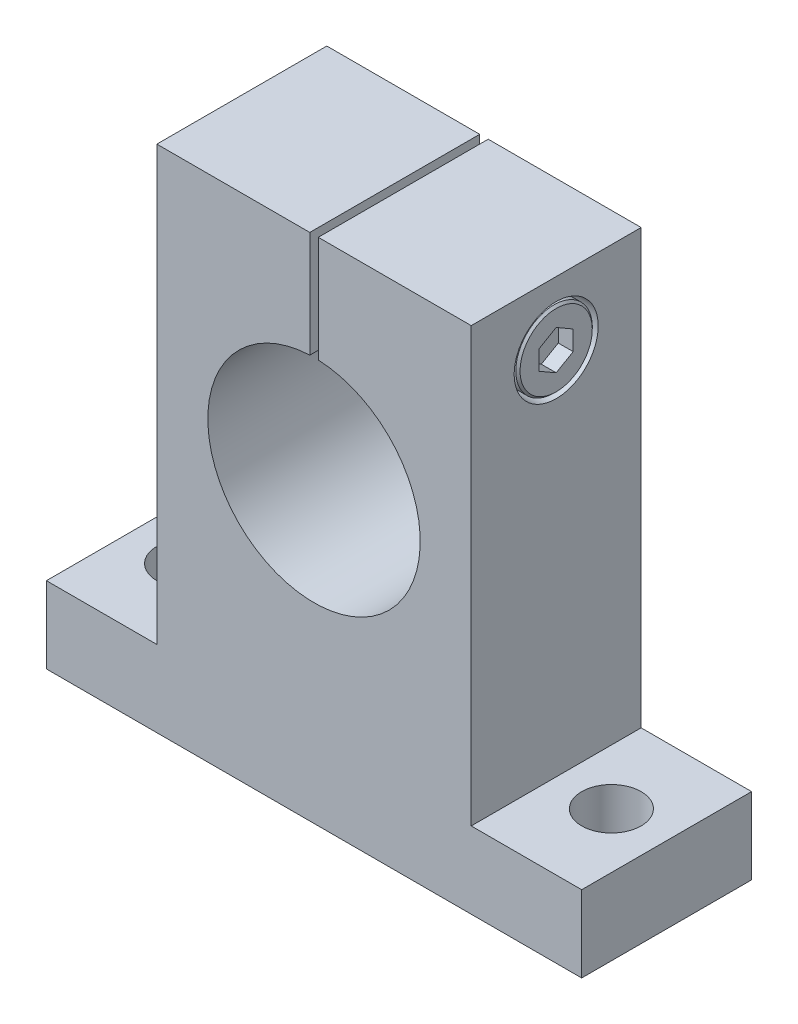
ISO-10303-21;
HEADER;
FILE_DESCRIPTION(('STEP AP214'),'2;1');
FILE_NAME('part.step','',(''),(''),'','','');
FILE_SCHEMA(('AUTOMOTIVE_DESIGN { 1 0 10303 214 1 1 1 1 }'));
ENDSEC;
DATA;
#1=APPLICATION_CONTEXT('core data for automotive mechanical design processes');
#2=APPLICATION_PROTOCOL_DEFINITION('international standard','automotive_design',2000,#1);
#3=PRODUCT_CONTEXT('',#1,'mechanical');
#4=PRODUCT('Part','Part','',(#3));
#5=PRODUCT_RELATED_PRODUCT_CATEGORY('part','',(#4));
#6=PRODUCT_DEFINITION_FORMATION('','',#4);
#7=PRODUCT_DEFINITION_CONTEXT('part definition',#1,'design');
#8=PRODUCT_DEFINITION('design','',#6,#7);
#9=PRODUCT_DEFINITION_SHAPE('','',#8);
#10=(LENGTH_UNIT() NAMED_UNIT(*) SI_UNIT(.MILLI.,.METRE.));
#11=(NAMED_UNIT(*) PLANE_ANGLE_UNIT() SI_UNIT($,.RADIAN.));
#12=(NAMED_UNIT(*) SI_UNIT($,.STERADIAN.) SOLID_ANGLE_UNIT());
#13=UNCERTAINTY_MEASURE_WITH_UNIT(LENGTH_MEASURE(1.E-05),#10,'distance_accuracy_value','');
#14=(GEOMETRIC_REPRESENTATION_CONTEXT(3) GLOBAL_UNCERTAINTY_ASSIGNED_CONTEXT((#13)) GLOBAL_UNIT_ASSIGNED_CONTEXT((#10,
#11,#12)) REPRESENTATION_CONTEXT('',''));
#15=CARTESIAN_POINT('',(0.,0.,0.));
#16=DIRECTION('',(0.,0.,1.));
#17=DIRECTION('',(1.,0.,0.));
#18=AXIS2_PLACEMENT_3D('',#15,#16,#17);
#19=CARTESIAN_POINT('',(0.,0.,-40.));
#20=DIRECTION('',(0.,0.,1.));
#21=DIRECTION('',(1.,0.,0.));
#22=AXIS2_PLACEMENT_3D('',#19,#20,#21);
#23=PLANE('',#22);
#24=DIRECTION('',(0.,1.,0.));
#25=VECTOR('',#24,1.);
#26=CARTESIAN_POINT('',(1.,0.,-40.));
#27=LINE('',#26,#25);
#28=CARTESIAN_POINT('',(1.,24.9799919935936,-40.));
#29=VERTEX_POINT('',#28);
#30=CARTESIAN_POINT('',(1.,50.,-40.));
#31=VERTEX_POINT('',#30);
#32=EDGE_CURVE('E323',#29,#31,#27,.T.);
#33=ORIENTED_EDGE('',*,*,#32,.T.);
#34=DIRECTION('',(-1.,0.,0.));
#35=VECTOR('',#34,1.);
#36=CARTESIAN_POINT('',(37.,50.,-40.));
#37=LINE('',#36,#35);
#38=CARTESIAN_POINT('',(37.,50.,-40.));
#39=VERTEX_POINT('',#38);
#40=EDGE_CURVE('E281',#39,#31,#37,.T.);
#41=ORIENTED_EDGE('',*,*,#40,.F.);
#42=DIRECTION('',(0.,1.,0.));
#43=VECTOR('',#42,1.);
#44=CARTESIAN_POINT('',(37.,-52.,-40.));
#45=LINE('',#44,#43);
#46=CARTESIAN_POINT('',(37.,-52.,-40.));
#47=VERTEX_POINT('',#46);
#48=EDGE_CURVE('E143',#47,#39,#45,.T.);
#49=ORIENTED_EDGE('',*,*,#48,.F.);
#50=DIRECTION('',(-1.,0.,0.));
#51=VECTOR('',#50,1.);
#52=CARTESIAN_POINT('',(63.,-52.,-40.));
#53=LINE('',#52,#51);
#54=CARTESIAN_POINT('',(63.,-52.,-40.));
#55=VERTEX_POINT('',#54);
#56=EDGE_CURVE('E133',#55,#47,#53,.T.);
#57=ORIENTED_EDGE('',*,*,#56,.F.);
#58=DIRECTION('',(0.,1.,0.));
#59=VECTOR('',#58,1.);
#60=CARTESIAN_POINT('',(63.,-70.,-40.));
#61=LINE('',#60,#59);
#62=CARTESIAN_POINT('',(63.,-70.,-40.));
#63=VERTEX_POINT('',#62);
#64=EDGE_CURVE('E373',#63,#55,#61,.T.);
#65=ORIENTED_EDGE('',*,*,#64,.F.);
#66=DIRECTION('',(1.,0.,0.));
#67=VECTOR('',#66,1.);
#68=CARTESIAN_POINT('',(-63.,-70.,-40.));
#69=LINE('',#68,#67);
#70=CARTESIAN_POINT('',(-63.,-70.,-40.));
#71=VERTEX_POINT('',#70);
#72=EDGE_CURVE('E10',#71,#63,#69,.T.);
#73=ORIENTED_EDGE('',*,*,#72,.F.);
#74=DIRECTION('',(0.,-1.,0.));
#75=VECTOR('',#74,1.);
#76=CARTESIAN_POINT('',(-63.,-52.,-40.));
#77=LINE('',#76,#75);
#78=CARTESIAN_POINT('',(-63.,-52.,-40.));
#79=VERTEX_POINT('',#78);
#80=EDGE_CURVE('E345',#79,#71,#77,.T.);
#81=ORIENTED_EDGE('',*,*,#80,.F.);
#82=DIRECTION('',(-1.,0.,0.));
#83=VECTOR('',#82,1.);
#84=CARTESIAN_POINT('',(-37.,-52.,-40.));
#85=LINE('',#84,#83);
#86=CARTESIAN_POINT('',(-37.,-52.,-40.));
#87=VERTEX_POINT('',#86);
#88=EDGE_CURVE('E306',#87,#79,#85,.T.);
#89=ORIENTED_EDGE('',*,*,#88,.F.);
#90=DIRECTION('',(0.,-1.,0.));
#91=VECTOR('',#90,1.);
#92=CARTESIAN_POINT('',(-37.,50.,-40.));
#93=LINE('',#92,#91);
#94=CARTESIAN_POINT('',(-37.,50.,-40.));
#95=VERTEX_POINT('',#94);
#96=EDGE_CURVE('E284',#95,#87,#93,.T.);
#97=ORIENTED_EDGE('',*,*,#96,.F.);
#98=DIRECTION('',(-1.,0.,0.));
#99=VECTOR('',#98,1.);
#100=CARTESIAN_POINT('',(37.,50.,-40.));
#101=LINE('',#100,#99);
#102=CARTESIAN_POINT('',(-1.,50.,-40.));
#103=VERTEX_POINT('',#102);
#104=EDGE_CURVE('E296',#103,#95,#101,.T.);
#105=ORIENTED_EDGE('',*,*,#104,.F.);
#106=DIRECTION('',(0.,-1.,0.));
#107=VECTOR('',#106,1.);
#108=CARTESIAN_POINT('',(-1.,25.,-40.));
#109=LINE('',#108,#107);
#110=CARTESIAN_POINT('',(-1.,24.9799919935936,-40.));
#111=VERTEX_POINT('',#110);
#112=EDGE_CURVE('E327',#103,#111,#109,.T.);
#113=ORIENTED_EDGE('',*,*,#112,.T.);
#114=CARTESIAN_POINT('',(0.,0.,-40.));
#115=DIRECTION('',(0.,0.,1.));
#116=DIRECTION('',(1.,0.,0.));
#117=AXIS2_PLACEMENT_3D('',#114,#115,#116);
#118=CIRCLE('',#117,25.);
#119=EDGE_CURVE('E470',#111,#29,#118,.T.);
#120=ORIENTED_EDGE('',*,*,#119,.T.);
#121=EDGE_LOOP('',(#33,#41,#49,#57,#65,#73,#81,#89,#97,#105,#113,#120));
#122=FACE_BOUND('',#121,.T.);
#123=ADVANCED_FACE('F16',(#122),#23,.F.);
#124=CARTESIAN_POINT('',(-63.,-70.,0.));
#125=DIRECTION('',(0.,-1.,0.));
#126=DIRECTION('',(0.,0.,-1.));
#127=AXIS2_PLACEMENT_3D('',#124,#125,#126);
#128=PLANE('',#127);
#129=CARTESIAN_POINT('',(50.,-70.,-20.));
#130=DIRECTION('',(0.,1.,0.));
#131=DIRECTION('',(0.,0.,-1.));
#132=AXIS2_PLACEMENT_3D('',#129,#130,#131);
#133=CIRCLE('',#132,7.);
#134=CARTESIAN_POINT('',(50.,-70.,-13.));
#135=VERTEX_POINT('',#134);
#136=EDGE_CURVE('E666',#135,#135,#133,.T.);
#137=ORIENTED_EDGE('',*,*,#136,.T.);
#138=EDGE_LOOP('',(#137));
#139=FACE_BOUND('',#138,.T.);
#140=CARTESIAN_POINT('',(-50.,-70.,-20.));
#141=DIRECTION('',(0.,1.,0.));
#142=DIRECTION('',(0.,0.,-1.));
#143=AXIS2_PLACEMENT_3D('',#140,#141,#142);
#144=CIRCLE('',#143,7.);
#145=CARTESIAN_POINT('',(-50.,-70.,-13.));
#146=VERTEX_POINT('',#145);
#147=EDGE_CURVE('E706',#146,#146,#144,.T.);
#148=ORIENTED_EDGE('',*,*,#147,.T.);
#149=EDGE_LOOP('',(#148));
#150=FACE_BOUND('',#149,.T.);
#151=ORIENTED_EDGE('',*,*,#72,.T.);
#152=DIRECTION('',(0.,0.,-1.));
#153=VECTOR('',#152,1.);
#154=CARTESIAN_POINT('',(63.,-70.,0.));
#155=LINE('',#154,#153);
#156=CARTESIAN_POINT('',(63.,-70.,0.));
#157=VERTEX_POINT('',#156);
#158=EDGE_CURVE('E377',#157,#63,#155,.T.);
#159=ORIENTED_EDGE('',*,*,#158,.F.);
#160=DIRECTION('',(1.,0.,0.));
#161=VECTOR('',#160,1.);
#162=CARTESIAN_POINT('',(-63.,-70.,0.));
#163=LINE('',#162,#161);
#164=CARTESIAN_POINT('',(-63.,-70.,0.));
#165=VERTEX_POINT('',#164);
#166=EDGE_CURVE('E319',#165,#157,#163,.T.);
#167=ORIENTED_EDGE('',*,*,#166,.F.);
#168=DIRECTION('',(0.,0.,-1.));
#169=VECTOR('',#168,1.);
#170=CARTESIAN_POINT('',(-63.,-70.,0.));
#171=LINE('',#170,#169);
#172=EDGE_CURVE('E19',#165,#71,#171,.T.);
#173=ORIENTED_EDGE('',*,*,#172,.T.);
#174=EDGE_LOOP('',(#151,#159,#167,#173));
#175=FACE_BOUND('',#174,.T.);
#176=ADVANCED_FACE('F532',(#139,#150,#175),#128,.T.);
#177=CARTESIAN_POINT('',(-63.,-52.,0.));
#178=DIRECTION('',(-1.,0.,0.));
#179=DIRECTION('',(0.,0.,1.));
#180=AXIS2_PLACEMENT_3D('',#177,#178,#179);
#181=PLANE('',#180);
#182=ORIENTED_EDGE('',*,*,#80,.T.);
#183=ORIENTED_EDGE('',*,*,#172,.F.);
#184=DIRECTION('',(0.,-1.,0.));
#185=VECTOR('',#184,1.);
#186=CARTESIAN_POINT('',(-63.,-52.,0.));
#187=LINE('',#186,#185);
#188=CARTESIAN_POINT('',(-63.,-52.,0.));
#189=VERTEX_POINT('',#188);
#190=EDGE_CURVE('E335',#189,#165,#187,.T.);
#191=ORIENTED_EDGE('',*,*,#190,.F.);
#192=DIRECTION('',(0.,0.,-1.));
#193=VECTOR('',#192,1.);
#194=CARTESIAN_POINT('',(-63.,-52.,0.));
#195=LINE('',#194,#193);
#196=EDGE_CURVE('E349',#189,#79,#195,.T.);
#197=ORIENTED_EDGE('',*,*,#196,.T.);
#198=EDGE_LOOP('',(#182,#183,#191,#197));
#199=FACE_BOUND('',#198,.T.);
#200=ADVANCED_FACE('F400',(#199),#181,.T.);
#201=CARTESIAN_POINT('',(-37.,-52.,0.));
#202=DIRECTION('',(0.,1.,0.));
#203=DIRECTION('',(1.,0.,0.));
#204=AXIS2_PLACEMENT_3D('',#201,#202,#203);
#205=PLANE('',#204);
#206=CARTESIAN_POINT('',(-50.,-52.,-20.));
#207=DIRECTION('',(0.,-1.,0.));
#208=DIRECTION('',(0.,0.,-1.));
#209=AXIS2_PLACEMENT_3D('',#206,#207,#208);
#210=CIRCLE('',#209,7.);
#211=CARTESIAN_POINT('',(-50.,-52.,-13.));
#212=VERTEX_POINT('',#211);
#213=EDGE_CURVE('E660',#212,#212,#210,.T.);
#214=ORIENTED_EDGE('',*,*,#213,.T.);
#215=EDGE_LOOP('',(#214));
#216=FACE_BOUND('',#215,.T.);
#217=ORIENTED_EDGE('',*,*,#88,.T.);
#218=ORIENTED_EDGE('',*,*,#196,.F.);
#219=DIRECTION('',(-1.,0.,0.));
#220=VECTOR('',#219,1.);
#221=CARTESIAN_POINT('',(-37.,-52.,0.));
#222=LINE('',#221,#220);
#223=CARTESIAN_POINT('',(-37.,-52.,0.));
#224=VERTEX_POINT('',#223);
#225=EDGE_CURVE('E353',#224,#189,#222,.T.);
#226=ORIENTED_EDGE('',*,*,#225,.F.);
#227=DIRECTION('',(0.,0.,-1.));
#228=VECTOR('',#227,1.);
#229=CARTESIAN_POINT('',(-37.,-52.,0.));
#230=LINE('',#229,#228);
#231=EDGE_CURVE('E302',#224,#87,#230,.T.);
#232=ORIENTED_EDGE('',*,*,#231,.T.);
#233=EDGE_LOOP('',(#217,#218,#226,#232));
#234=FACE_BOUND('',#233,.T.);
#235=ADVANCED_FACE('F404',(#216,#234),#205,.T.);
#236=CARTESIAN_POINT('',(-37.,50.,0.));
#237=DIRECTION('',(-1.,0.,0.));
#238=DIRECTION('',(0.,0.,1.));
#239=AXIS2_PLACEMENT_3D('',#236,#237,#238);
#240=PLANE('',#239);
#241=ORIENTED_EDGE('',*,*,#96,.T.);
#242=ORIENTED_EDGE('',*,*,#231,.F.);
#243=DIRECTION('',(0.,-1.,0.));
#244=VECTOR('',#243,1.);
#245=CARTESIAN_POINT('',(-37.,50.,0.));
#246=LINE('',#245,#244);
#247=CARTESIAN_POINT('',(-37.,50.,0.));
#248=VERTEX_POINT('',#247);
#249=EDGE_CURVE('E344',#248,#224,#246,.T.);
#250=ORIENTED_EDGE('',*,*,#249,.F.);
#251=DIRECTION('',(0.,0.,-1.));
#252=VECTOR('',#251,1.);
#253=CARTESIAN_POINT('',(-37.,50.,0.));
#254=LINE('',#253,#252);
#255=EDGE_CURVE('E369',#248,#95,#254,.T.);
#256=ORIENTED_EDGE('',*,*,#255,.T.);
#257=EDGE_LOOP('',(#241,#242,#250,#256));
#258=FACE_BOUND('',#257,.T.);
#259=ADVANCED_FACE('F456',(#258),#240,.T.);
#260=CARTESIAN_POINT('',(37.,50.,0.));
#261=DIRECTION('',(0.,1.,0.));
#262=DIRECTION('',(1.,0.,0.));
#263=AXIS2_PLACEMENT_3D('',#260,#261,#262);
#264=PLANE('',#263);
#265=DIRECTION('',(0.,0.,1.));
#266=VECTOR('',#265,1.);
#267=CARTESIAN_POINT('',(1.,50.,0.));
#268=LINE('',#267,#266);
#269=CARTESIAN_POINT('',(1.,50.,0.));
#270=VERTEX_POINT('',#269);
#271=EDGE_CURVE('E313',#31,#270,#268,.T.);
#272=ORIENTED_EDGE('',*,*,#271,.T.);
#273=DIRECTION('',(-1.,0.,0.));
#274=VECTOR('',#273,1.);
#275=CARTESIAN_POINT('',(37.,50.,0.));
#276=LINE('',#275,#274);
#277=CARTESIAN_POINT('',(37.,50.,0.));
#278=VERTEX_POINT('',#277);
#279=EDGE_CURVE('E293',#278,#270,#276,.T.);
#280=ORIENTED_EDGE('',*,*,#279,.F.);
#281=DIRECTION('',(0.,0.,-1.));
#282=VECTOR('',#281,1.);
#283=CARTESIAN_POINT('',(37.,50.,0.));
#284=LINE('',#283,#282);
#285=EDGE_CURVE('E285',#278,#39,#284,.T.);
#286=ORIENTED_EDGE('',*,*,#285,.T.);
#287=ORIENTED_EDGE('',*,*,#40,.T.);
#288=EDGE_LOOP('',(#272,#280,#286,#287));
#289=FACE_BOUND('',#288,.T.);
#290=ADVANCED_FACE('F812',(#289),#264,.T.);
#291=CARTESIAN_POINT('',(37.,-52.,0.));
#292=DIRECTION('',(1.,0.,0.));
#293=DIRECTION('',(0.,1.,0.));
#294=AXIS2_PLACEMENT_3D('',#291,#292,#293);
#295=PLANE('',#294);
#296=CARTESIAN_POINT('',(37.,35.,-20.));
#297=DIRECTION('',(-1.,0.,0.));
#298=DIRECTION('',(0.,0.,-1.));
#299=AXIS2_PLACEMENT_3D('',#296,#297,#298);
#300=CIRCLE('',#299,9.9);
#301=CARTESIAN_POINT('',(37.,35.,-10.1));
#302=VERTEX_POINT('',#301);
#303=EDGE_CURVE('E483',#302,#302,#300,.T.);
#304=ORIENTED_EDGE('',*,*,#303,.T.);
#305=EDGE_LOOP('',(#304));
#306=FACE_BOUND('',#305,.T.);
#307=ORIENTED_EDGE('',*,*,#48,.T.);
#308=ORIENTED_EDGE('',*,*,#285,.F.);
#309=DIRECTION('',(0.,1.,0.));
#310=VECTOR('',#309,1.);
#311=CARTESIAN_POINT('',(37.,-52.,0.));
#312=LINE('',#311,#310);
#313=CARTESIAN_POINT('',(37.,-52.,0.));
#314=VERTEX_POINT('',#313);
#315=EDGE_CURVE('E297',#314,#278,#312,.T.);
#316=ORIENTED_EDGE('',*,*,#315,.F.);
#317=DIRECTION('',(0.,0.,-1.));
#318=VECTOR('',#317,1.);
#319=CARTESIAN_POINT('',(37.,-52.,0.));
#320=LINE('',#319,#318);
#321=EDGE_CURVE('E381',#314,#47,#320,.T.);
#322=ORIENTED_EDGE('',*,*,#321,.T.);
#323=EDGE_LOOP('',(#307,#308,#316,#322));
#324=FACE_BOUND('',#323,.T.);
#325=ADVANCED_FACE('F484',(#306,#324),#295,.T.);
#326=CARTESIAN_POINT('',(63.,-52.,0.));
#327=DIRECTION('',(0.,1.,0.));
#328=DIRECTION('',(1.,0.,0.));
#329=AXIS2_PLACEMENT_3D('',#326,#327,#328);
#330=PLANE('',#329);
#331=CARTESIAN_POINT('',(50.,-52.,-20.));
#332=DIRECTION('',(0.,-1.,0.));
#333=DIRECTION('',(0.,0.,-1.));
#334=AXIS2_PLACEMENT_3D('',#331,#332,#333);
#335=CIRCLE('',#334,7.);
#336=CARTESIAN_POINT('',(50.,-52.,-13.));
#337=VERTEX_POINT('',#336);
#338=EDGE_CURVE('E674',#337,#337,#335,.T.);
#339=ORIENTED_EDGE('',*,*,#338,.T.);
#340=EDGE_LOOP('',(#339));
#341=FACE_BOUND('',#340,.T.);
#342=ORIENTED_EDGE('',*,*,#56,.T.);
#343=ORIENTED_EDGE('',*,*,#321,.F.);
#344=DIRECTION('',(-1.,0.,0.));
#345=VECTOR('',#344,1.);
#346=CARTESIAN_POINT('',(63.,-52.,0.));
#347=LINE('',#346,#345);
#348=CARTESIAN_POINT('',(63.,-52.,0.));
#349=VERTEX_POINT('',#348);
#350=EDGE_CURVE('E318',#349,#314,#347,.T.);
#351=ORIENTED_EDGE('',*,*,#350,.F.);
#352=DIRECTION('',(0.,0.,-1.));
#353=VECTOR('',#352,1.);
#354=CARTESIAN_POINT('',(63.,-52.,0.));
#355=LINE('',#354,#353);
#356=EDGE_CURVE('E374',#349,#55,#355,.T.);
#357=ORIENTED_EDGE('',*,*,#356,.T.);
#358=EDGE_LOOP('',(#342,#343,#351,#357));
#359=FACE_BOUND('',#358,.T.);
#360=ADVANCED_FACE('F814',(#341,#359),#330,.T.);
#361=CARTESIAN_POINT('',(63.,-70.,0.));
#362=DIRECTION('',(1.,0.,0.));
#363=DIRECTION('',(0.,1.,0.));
#364=AXIS2_PLACEMENT_3D('',#361,#362,#363);
#365=PLANE('',#364);
#366=ORIENTED_EDGE('',*,*,#64,.T.);
#367=ORIENTED_EDGE('',*,*,#356,.F.);
#368=DIRECTION('',(0.,1.,0.));
#369=VECTOR('',#368,1.);
#370=CARTESIAN_POINT('',(63.,-70.,0.));
#371=LINE('',#370,#369);
#372=EDGE_CURVE('E314',#157,#349,#371,.T.);
#373=ORIENTED_EDGE('',*,*,#372,.F.);
#374=ORIENTED_EDGE('',*,*,#158,.T.);
#375=EDGE_LOOP('',(#366,#367,#373,#374));
#376=FACE_BOUND('',#375,.T.);
#377=ADVANCED_FACE('F527',(#376),#365,.T.);
#378=CARTESIAN_POINT('',(37.,50.,0.));
#379=DIRECTION('',(0.,1.,0.));
#380=DIRECTION('',(1.,0.,0.));
#381=AXIS2_PLACEMENT_3D('',#378,#379,#380);
#382=PLANE('',#381);
#383=DIRECTION('',(0.,0.,-1.));
#384=VECTOR('',#383,1.);
#385=CARTESIAN_POINT('',(-1.,50.,0.));
#386=LINE('',#385,#384);
#387=CARTESIAN_POINT('',(-1.,50.,0.));
#388=VERTEX_POINT('',#387);
#389=EDGE_CURVE('E331',#388,#103,#386,.T.);
#390=ORIENTED_EDGE('',*,*,#389,.T.);
#391=ORIENTED_EDGE('',*,*,#104,.T.);
#392=ORIENTED_EDGE('',*,*,#255,.F.);
#393=DIRECTION('',(-1.,0.,0.));
#394=VECTOR('',#393,1.);
#395=CARTESIAN_POINT('',(37.,50.,0.));
#396=LINE('',#395,#394);
#397=EDGE_CURVE('E340',#388,#248,#396,.T.);
#398=ORIENTED_EDGE('',*,*,#397,.F.);
#399=EDGE_LOOP('',(#390,#391,#392,#398));
#400=FACE_BOUND('',#399,.T.);
#401=ADVANCED_FACE('F458',(#400),#382,.T.);
#402=CARTESIAN_POINT('',(0.,0.,0.));
#403=DIRECTION('',(0.,0.,1.));
#404=DIRECTION('',(1.,0.,0.));
#405=AXIS2_PLACEMENT_3D('',#402,#403,#404);
#406=PLANE('',#405);
#407=DIRECTION('',(0.,-1.,0.));
#408=VECTOR('',#407,1.);
#409=CARTESIAN_POINT('',(1.,0.,0.));
#410=LINE('',#409,#408);
#411=CARTESIAN_POINT('',(1.,24.9799919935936,0.));
#412=VERTEX_POINT('',#411);
#413=EDGE_CURVE('E234',#270,#412,#410,.T.);
#414=ORIENTED_EDGE('',*,*,#413,.T.);
#415=CARTESIAN_POINT('',(0.,0.,0.));
#416=DIRECTION('',(0.,0.,-1.));
#417=DIRECTION('',(1.,0.,0.));
#418=AXIS2_PLACEMENT_3D('',#415,#416,#417);
#419=CIRCLE('',#418,25.);
#420=CARTESIAN_POINT('',(-1.,24.9799919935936,0.));
#421=VERTEX_POINT('',#420);
#422=EDGE_CURVE('E646',#412,#421,#419,.T.);
#423=ORIENTED_EDGE('',*,*,#422,.T.);
#424=DIRECTION('',(0.,1.,0.));
#425=VECTOR('',#424,1.);
#426=CARTESIAN_POINT('',(-1.,25.,0.));
#427=LINE('',#426,#425);
#428=EDGE_CURVE('E339',#421,#388,#427,.T.);
#429=ORIENTED_EDGE('',*,*,#428,.T.);
#430=ORIENTED_EDGE('',*,*,#397,.T.);
#431=ORIENTED_EDGE('',*,*,#249,.T.);
#432=ORIENTED_EDGE('',*,*,#225,.T.);
#433=ORIENTED_EDGE('',*,*,#190,.T.);
#434=ORIENTED_EDGE('',*,*,#166,.T.);
#435=ORIENTED_EDGE('',*,*,#372,.T.);
#436=ORIENTED_EDGE('',*,*,#350,.T.);
#437=ORIENTED_EDGE('',*,*,#315,.T.);
#438=ORIENTED_EDGE('',*,*,#279,.T.);
#439=EDGE_LOOP('',(#414,#423,#429,#430,#431,#432,#433,#434,#435,#436,#437,#438));
#440=FACE_BOUND('',#439,.T.);
#441=ADVANCED_FACE('F808',(#440),#406,.T.);
#442=CARTESIAN_POINT('',(-1.,50.,0.));
#443=DIRECTION('',(-1.,0.,0.));
#444=DIRECTION('',(0.,0.,1.));
#445=AXIS2_PLACEMENT_3D('',#442,#443,#444);
#446=PLANE('',#445);
#447=CARTESIAN_POINT('',(-1.,35.,-20.));
#448=DIRECTION('',(-1.,0.,0.));
#449=DIRECTION('',(0.,1.,0.));
#450=AXIS2_PLACEMENT_3D('',#447,#448,#449);
#451=CIRCLE('',#450,6.);
#452=CARTESIAN_POINT('',(-1.,29.,-20.));
#453=VERTEX_POINT('',#452);
#454=EDGE_CURVE('E502',#453,#453,#451,.T.);
#455=ORIENTED_EDGE('',*,*,#454,.T.);
#456=EDGE_LOOP('',(#455));
#457=FACE_BOUND('',#456,.T.);
#458=DIRECTION('',(0.,0.,1.));
#459=VECTOR('',#458,1.);
#460=CARTESIAN_POINT('',(-1.,24.9799919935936,-20.));
#461=LINE('',#460,#459);
#462=EDGE_CURVE('E467',#111,#421,#461,.T.);
#463=ORIENTED_EDGE('',*,*,#462,.F.);
#464=ORIENTED_EDGE('',*,*,#112,.F.);
#465=ORIENTED_EDGE('',*,*,#389,.F.);
#466=ORIENTED_EDGE('',*,*,#428,.F.);
#467=EDGE_LOOP('',(#463,#464,#465,#466));
#468=FACE_BOUND('',#467,.T.);
#469=ADVANCED_FACE('F464',(#457,#468),#446,.F.);
#470=CARTESIAN_POINT('',(1.,0.,0.));
#471=DIRECTION('',(1.,0.,0.));
#472=DIRECTION('',(0.,1.,0.));
#473=AXIS2_PLACEMENT_3D('',#470,#471,#472);
#474=PLANE('',#473);
#475=CARTESIAN_POINT('',(1.,35.,-20.));
#476=DIRECTION('',(1.,0.,0.));
#477=DIRECTION('',(0.,1.,0.));
#478=AXIS2_PLACEMENT_3D('',#475,#476,#477);
#479=CIRCLE('',#478,6.);
#480=CARTESIAN_POINT('',(1.,29.,-20.));
#481=VERTEX_POINT('',#480);
#482=EDGE_CURVE('E699',#481,#481,#479,.T.);
#483=ORIENTED_EDGE('',*,*,#482,.T.);
#484=EDGE_LOOP('',(#483));
#485=FACE_BOUND('',#484,.T.);
#486=DIRECTION('',(0.,0.,-1.));
#487=VECTOR('',#486,1.);
#488=CARTESIAN_POINT('',(1.,24.9799919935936,-20.));
#489=LINE('',#488,#487);
#490=EDGE_CURVE('E656',#412,#29,#489,.T.);
#491=ORIENTED_EDGE('',*,*,#490,.F.);
#492=ORIENTED_EDGE('',*,*,#413,.F.);
#493=ORIENTED_EDGE('',*,*,#271,.F.);
#494=ORIENTED_EDGE('',*,*,#32,.F.);
#495=EDGE_LOOP('',(#491,#492,#493,#494));
#496=FACE_BOUND('',#495,.T.);
#497=ADVANCED_FACE('F796',(#485,#496),#474,.F.);
#498=CARTESIAN_POINT('',(30.,0.,0.));
#499=DIRECTION('',(1.,0.,0.));
#500=DIRECTION('',(0.,1.,0.));
#501=AXIS2_PLACEMENT_3D('',#498,#499,#500);
#502=PLANE('',#501);
#503=CARTESIAN_POINT('',(30.,35.,-20.));
#504=DIRECTION('',(-1.,0.,0.));
#505=DIRECTION('',(0.,1.,0.));
#506=AXIS2_PLACEMENT_3D('',#503,#504,#505);
#507=CIRCLE('',#506,9.);
#508=CARTESIAN_POINT('',(30.,26.,-20.));
#509=VERTEX_POINT('',#508);
#510=EDGE_CURVE('E508',#509,#509,#507,.T.);
#511=ORIENTED_EDGE('',*,*,#510,.T.);
#512=EDGE_LOOP('',(#511));
#513=FACE_BOUND('',#512,.T.);
#514=CARTESIAN_POINT('',(30.,35.,-20.));
#515=DIRECTION('',(1.,0.,0.));
#516=DIRECTION('',(0.,0.,-1.));
#517=AXIS2_PLACEMENT_3D('',#514,#515,#516);
#518=CIRCLE('',#517,9.9);
#519=CARTESIAN_POINT('',(30.,35.,-10.1));
#520=VERTEX_POINT('',#519);
#521=EDGE_CURVE('E499',#520,#520,#518,.T.);
#522=ORIENTED_EDGE('',*,*,#521,.T.);
#523=EDGE_LOOP('',(#522));
#524=FACE_BOUND('',#523,.T.);
#525=ADVANCED_FACE('F799',(#513,#524),#502,.T.);
#526=CARTESIAN_POINT('',(37.,39.25,-20.));
#527=DIRECTION('',(1.,0.,0.));
#528=DIRECTION('',(0.,1.,0.));
#529=AXIS2_PLACEMENT_3D('',#526,#527,#528);
#530=PLANE('',#529);
#531=DIRECTION('',(0.,0.5,0.866025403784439));
#532=VECTOR('',#531,1.);
#533=CARTESIAN_POINT('',(37.,32.6444986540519,-16.079848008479));
#534=LINE('',#533,#532);
#535=CARTESIAN_POINT('',(37.,30.381197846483,-20.));
#536=VERTEX_POINT('',#535);
#537=CARTESIAN_POINT('',(37.,32.6905989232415,-16.));
#538=VERTEX_POINT('',#537);
#539=EDGE_CURVE('E238',#536,#538,#534,.T.);
#540=ORIENTED_EDGE('',*,*,#539,.T.);
#541=DIRECTION('',(0.,1.,0.));
#542=VECTOR('',#541,1.);
#543=CARTESIAN_POINT('',(37.,38.2797005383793,-16.));
#544=LINE('',#543,#542);
#545=CARTESIAN_POINT('',(37.,37.3094010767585,-16.));
#546=VERTEX_POINT('',#545);
#547=EDGE_CURVE('E223',#538,#546,#544,.T.);
#548=ORIENTED_EDGE('',*,*,#547,.T.);
#549=DIRECTION('',(0.,0.5,-0.866025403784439));
#550=VECTOR('',#549,1.);
#551=CARTESIAN_POINT('',(37.,39.5727018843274,-19.920151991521));
#552=LINE('',#551,#550);
#553=CARTESIAN_POINT('',(37.,39.618802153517,-20.));
#554=VERTEX_POINT('',#553);
#555=EDGE_CURVE('E269',#546,#554,#552,.T.);
#556=ORIENTED_EDGE('',*,*,#555,.T.);
#557=DIRECTION('',(0.,-0.5,-0.866025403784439));
#558=VECTOR('',#557,1.);
#559=CARTESIAN_POINT('',(37.,38.4180013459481,-22.079848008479));
#560=LINE('',#559,#558);
#561=CARTESIAN_POINT('',(37.,37.3094010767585,-24.));
#562=VERTEX_POINT('',#561);
#563=EDGE_CURVE('E289',#554,#562,#560,.T.);
#564=ORIENTED_EDGE('',*,*,#563,.T.);
#565=DIRECTION('',(0.,-1.,0.));
#566=VECTOR('',#565,1.);
#567=CARTESIAN_POINT('',(37.,35.9702994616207,-24.));
#568=LINE('',#567,#566);
#569=CARTESIAN_POINT('',(37.,32.6905989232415,-24.));
#570=VERTEX_POINT('',#569);
#571=EDGE_CURVE('E273',#562,#570,#568,.T.);
#572=ORIENTED_EDGE('',*,*,#571,.T.);
#573=DIRECTION('',(0.,-0.5,0.866025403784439));
#574=VECTOR('',#573,1.);
#575=CARTESIAN_POINT('',(37.,31.4897981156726,-21.920151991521));
#576=LINE('',#575,#574);
#577=EDGE_CURVE('E242',#570,#536,#576,.T.);
#578=ORIENTED_EDGE('',*,*,#577,.T.);
#579=EDGE_LOOP('',(#540,#548,#556,#564,#572,#578));
#580=FACE_BOUND('',#579,.T.);
#581=CARTESIAN_POINT('',(37.,35.,-20.));
#582=DIRECTION('',(-1.,0.,0.));
#583=DIRECTION('',(0.,1.,0.));
#584=AXIS2_PLACEMENT_3D('',#581,#582,#583);
#585=CIRCLE('',#584,8.5);
#586=CARTESIAN_POINT('',(37.,26.5,-20.));
#587=VERTEX_POINT('',#586);
#588=EDGE_CURVE('E256',#587,#587,#585,.T.);
#589=ORIENTED_EDGE('',*,*,#588,.F.);
#590=EDGE_LOOP('',(#589));
#591=FACE_BOUND('',#590,.T.);
#592=ADVANCED_FACE('F239',(#580,#591),#530,.T.);
#593=CARTESIAN_POINT('',(33.5,0.,0.));
#594=DIRECTION('',(1.,0.,0.));
#595=DIRECTION('',(0.,1.,0.));
#596=AXIS2_PLACEMENT_3D('',#593,#594,#595);
#597=PLANE('',#596);
#598=DIRECTION('',(0.,-0.5,-0.866025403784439));
#599=VECTOR('',#598,1.);
#600=CARTESIAN_POINT('',(33.5,32.6905989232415,-16.));
#601=LINE('',#600,#599);
#602=CARTESIAN_POINT('',(33.5,32.6905989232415,-16.));
#603=VERTEX_POINT('',#602);
#604=CARTESIAN_POINT('',(33.5,30.381197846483,-20.));
#605=VERTEX_POINT('',#604);
#606=EDGE_CURVE('E249',#603,#605,#601,.T.);
#607=ORIENTED_EDGE('',*,*,#606,.T.);
#608=DIRECTION('',(0.,0.5,-0.866025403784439));
#609=VECTOR('',#608,1.);
#610=CARTESIAN_POINT('',(33.5,30.381197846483,-20.));
#611=LINE('',#610,#609);
#612=CARTESIAN_POINT('',(33.5,32.6905989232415,-24.));
#613=VERTEX_POINT('',#612);
#614=EDGE_CURVE('E216',#605,#613,#611,.T.);
#615=ORIENTED_EDGE('',*,*,#614,.T.);
#616=DIRECTION('',(0.,1.,0.));
#617=VECTOR('',#616,1.);
#618=CARTESIAN_POINT('',(33.5,32.6905989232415,-24.));
#619=LINE('',#618,#617);
#620=CARTESIAN_POINT('',(33.5,37.3094010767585,-24.));
#621=VERTEX_POINT('',#620);
#622=EDGE_CURVE('E272',#613,#621,#619,.T.);
#623=ORIENTED_EDGE('',*,*,#622,.T.);
#624=DIRECTION('',(0.,0.5,0.866025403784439));
#625=VECTOR('',#624,1.);
#626=CARTESIAN_POINT('',(33.5,37.3094010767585,-24.));
#627=LINE('',#626,#625);
#628=CARTESIAN_POINT('',(33.5,39.618802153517,-20.));
#629=VERTEX_POINT('',#628);
#630=EDGE_CURVE('E280',#621,#629,#627,.T.);
#631=ORIENTED_EDGE('',*,*,#630,.T.);
#632=DIRECTION('',(0.,-0.5,0.866025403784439));
#633=VECTOR('',#632,1.);
#634=CARTESIAN_POINT('',(33.5,39.618802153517,-20.));
#635=LINE('',#634,#633);
#636=CARTESIAN_POINT('',(33.5,37.3094010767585,-16.));
#637=VERTEX_POINT('',#636);
#638=EDGE_CURVE('E298',#629,#637,#635,.T.);
#639=ORIENTED_EDGE('',*,*,#638,.T.);
#640=DIRECTION('',(0.,-1.,0.));
#641=VECTOR('',#640,1.);
#642=CARTESIAN_POINT('',(33.5,37.3094010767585,-16.));
#643=LINE('',#642,#641);
#644=EDGE_CURVE('E235',#637,#603,#643,.T.);
#645=ORIENTED_EDGE('',*,*,#644,.T.);
#646=EDGE_LOOP('',(#607,#615,#623,#631,#639,#645));
#647=FACE_BOUND('',#646,.T.);
#648=ADVANCED_FACE('F882',(#647),#597,.T.);
#649=CARTESIAN_POINT('',(37.,37.3094010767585,-16.));
#650=DIRECTION('',(0.,0.,1.));
#651=DIRECTION('',(1.,0.,0.));
#652=AXIS2_PLACEMENT_3D('',#649,#650,#651);
#653=PLANE('',#652);
#654=ORIENTED_EDGE('',*,*,#644,.F.);
#655=DIRECTION('',(-1.,0.,0.));
#656=VECTOR('',#655,1.);
#657=CARTESIAN_POINT('',(37.,37.3094010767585,-16.));
#658=LINE('',#657,#656);
#659=EDGE_CURVE('E230',#546,#637,#658,.T.);
#660=ORIENTED_EDGE('',*,*,#659,.F.);
#661=ORIENTED_EDGE('',*,*,#547,.F.);
#662=DIRECTION('',(-1.,0.,0.));
#663=VECTOR('',#662,1.);
#664=CARTESIAN_POINT('',(37.,32.6905989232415,-16.));
#665=LINE('',#664,#663);
#666=EDGE_CURVE('E227',#538,#603,#665,.T.);
#667=ORIENTED_EDGE('',*,*,#666,.T.);
#668=EDGE_LOOP('',(#654,#660,#661,#667));
#669=FACE_BOUND('',#668,.T.);
#670=ADVANCED_FACE('F225',(#669),#653,.F.);
#671=CARTESIAN_POINT('',(37.,39.618802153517,-20.));
#672=DIRECTION('',(0.,0.866025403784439,0.5));
#673=DIRECTION('',(1.,0.,0.));
#674=AXIS2_PLACEMENT_3D('',#671,#672,#673);
#675=PLANE('',#674);
#676=ORIENTED_EDGE('',*,*,#638,.F.);
#677=DIRECTION('',(-1.,0.,0.));
#678=VECTOR('',#677,1.);
#679=CARTESIAN_POINT('',(37.,39.618802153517,-20.));
#680=LINE('',#679,#678);
#681=EDGE_CURVE('E292',#554,#629,#680,.T.);
#682=ORIENTED_EDGE('',*,*,#681,.F.);
#683=ORIENTED_EDGE('',*,*,#555,.F.);
#684=ORIENTED_EDGE('',*,*,#659,.T.);
#685=EDGE_LOOP('',(#676,#682,#683,#684));
#686=FACE_BOUND('',#685,.T.);
#687=ADVANCED_FACE('F875',(#686),#675,.F.);
#688=CARTESIAN_POINT('',(37.,37.3094010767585,-24.));
#689=DIRECTION('',(0.,0.866025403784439,-0.5));
#690=DIRECTION('',(-1.,0.,0.));
#691=AXIS2_PLACEMENT_3D('',#688,#689,#690);
#692=PLANE('',#691);
#693=ORIENTED_EDGE('',*,*,#630,.F.);
#694=DIRECTION('',(-1.,0.,0.));
#695=VECTOR('',#694,1.);
#696=CARTESIAN_POINT('',(37.,37.3094010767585,-24.));
#697=LINE('',#696,#695);
#698=EDGE_CURVE('E276',#562,#621,#697,.T.);
#699=ORIENTED_EDGE('',*,*,#698,.F.);
#700=ORIENTED_EDGE('',*,*,#563,.F.);
#701=ORIENTED_EDGE('',*,*,#681,.T.);
#702=EDGE_LOOP('',(#693,#699,#700,#701));
#703=FACE_BOUND('',#702,.T.);
#704=ADVANCED_FACE('F871',(#703),#692,.F.);
#705=CARTESIAN_POINT('',(37.,32.6905989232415,-24.));
#706=DIRECTION('',(0.,0.,-1.));
#707=DIRECTION('',(0.,-1.,0.));
#708=AXIS2_PLACEMENT_3D('',#705,#706,#707);
#709=PLANE('',#708);
#710=ORIENTED_EDGE('',*,*,#622,.F.);
#711=DIRECTION('',(-1.,0.,0.));
#712=VECTOR('',#711,1.);
#713=CARTESIAN_POINT('',(37.,32.6905989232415,-24.));
#714=LINE('',#713,#712);
#715=EDGE_CURVE('E266',#570,#613,#714,.T.);
#716=ORIENTED_EDGE('',*,*,#715,.F.);
#717=ORIENTED_EDGE('',*,*,#571,.F.);
#718=ORIENTED_EDGE('',*,*,#698,.T.);
#719=EDGE_LOOP('',(#710,#716,#717,#718));
#720=FACE_BOUND('',#719,.T.);
#721=ADVANCED_FACE('F874',(#720),#709,.F.);
#722=CARTESIAN_POINT('',(37.,30.381197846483,-20.));
#723=DIRECTION('',(0.,-0.866025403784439,-0.5));
#724=DIRECTION('',(0.,0.5,-0.866025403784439));
#725=AXIS2_PLACEMENT_3D('',#722,#723,#724);
#726=PLANE('',#725);
#727=ORIENTED_EDGE('',*,*,#614,.F.);
#728=DIRECTION('',(-1.,0.,0.));
#729=VECTOR('',#728,1.);
#730=CARTESIAN_POINT('',(37.,30.381197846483,-20.));
#731=LINE('',#730,#729);
#732=EDGE_CURVE('E245',#536,#605,#731,.T.);
#733=ORIENTED_EDGE('',*,*,#732,.F.);
#734=ORIENTED_EDGE('',*,*,#577,.F.);
#735=ORIENTED_EDGE('',*,*,#715,.T.);
#736=EDGE_LOOP('',(#727,#733,#734,#735));
#737=FACE_BOUND('',#736,.T.);
#738=ADVANCED_FACE('F885',(#737),#726,.F.);
#739=CARTESIAN_POINT('',(37.,32.6905989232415,-16.));
#740=DIRECTION('',(0.,-0.866025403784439,0.5));
#741=DIRECTION('',(-1.,0.,0.));
#742=AXIS2_PLACEMENT_3D('',#739,#740,#741);
#743=PLANE('',#742);
#744=ORIENTED_EDGE('',*,*,#606,.F.);
#745=ORIENTED_EDGE('',*,*,#666,.F.);
#746=ORIENTED_EDGE('',*,*,#539,.F.);
#747=ORIENTED_EDGE('',*,*,#732,.T.);
#748=EDGE_LOOP('',(#744,#745,#746,#747));
#749=FACE_BOUND('',#748,.T.);
#750=ADVANCED_FACE('F247',(#749),#743,.F.);
#751=CARTESIAN_POINT('',(36.75,35.,-20.));
#752=DIRECTION('',(-1.,0.,0.));
#753=DIRECTION('',(0.,1.,0.));
#754=AXIS2_PLACEMENT_3D('',#751,#752,#753);
#755=CONICAL_SURFACE('',#754,8.75,0.785398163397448);
#756=CARTESIAN_POINT('',(36.5,35.,-20.));
#757=DIRECTION('',(-1.,0.,0.));
#758=DIRECTION('',(0.,1.,0.));
#759=AXIS2_PLACEMENT_3D('',#756,#757,#758);
#760=CIRCLE('',#759,9.);
#761=CARTESIAN_POINT('',(36.5,26.,-20.));
#762=VERTEX_POINT('',#761);
#763=EDGE_CURVE('E489',#762,#762,#760,.T.);
#764=ORIENTED_EDGE('',*,*,#763,.F.);
#765=DIRECTION('',(0.707106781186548,0.707106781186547,0.));
#766=VECTOR('',#765,1.);
#767=CARTESIAN_POINT('',(36.75,26.25,-20.));
#768=LINE('',#767,#766);
#769=EDGE_CURVE('E512',#762,#587,#768,.T.);
#770=ORIENTED_EDGE('',*,*,#769,.T.);
#771=ORIENTED_EDGE('',*,*,#588,.T.);
#772=ORIENTED_EDGE('',*,*,#769,.F.);
#773=EDGE_LOOP('',(#764,#770,#771,#772));
#774=FACE_BOUND('',#773,.T.);
#775=ADVANCED_FACE('F869',(#774),#755,.T.);
#776=CARTESIAN_POINT('',(33.25,35.,-20.));
#777=DIRECTION('',(1.,0.,0.));
#778=DIRECTION('',(0.,1.,0.));
#779=AXIS2_PLACEMENT_3D('',#776,#777,#778);
#780=CYLINDRICAL_SURFACE('',#779,9.);
#781=ORIENTED_EDGE('',*,*,#763,.T.);
#782=DIRECTION('',(-1.,0.,0.));
#783=VECTOR('',#782,1.);
#784=CARTESIAN_POINT('',(33.25,26.,-20.));
#785=LINE('',#784,#783);
#786=EDGE_CURVE('E497',#762,#509,#785,.T.);
#787=ORIENTED_EDGE('',*,*,#786,.T.);
#788=ORIENTED_EDGE('',*,*,#510,.F.);
#789=ORIENTED_EDGE('',*,*,#786,.F.);
#790=EDGE_LOOP('',(#781,#787,#788,#789));
#791=FACE_BOUND('',#790,.T.);
#792=ADVANCED_FACE('F866',(#791),#780,.T.);
#793=CARTESIAN_POINT('',(37.,35.,-20.));
#794=DIRECTION('',(1.,0.,0.));
#795=DIRECTION('',(0.,0.,-1.));
#796=AXIS2_PLACEMENT_3D('',#793,#794,#795);
#797=CYLINDRICAL_SURFACE('',#796,9.9);
#798=ORIENTED_EDGE('',*,*,#521,.F.);
#799=DIRECTION('',(1.,0.,0.));
#800=VECTOR('',#799,1.);
#801=CARTESIAN_POINT('',(37.,35.,-10.1));
#802=LINE('',#801,#800);
#803=EDGE_CURVE('E490',#520,#302,#802,.T.);
#804=ORIENTED_EDGE('',*,*,#803,.T.);
#805=ORIENTED_EDGE('',*,*,#303,.F.);
#806=ORIENTED_EDGE('',*,*,#803,.F.);
#807=EDGE_LOOP('',(#798,#804,#805,#806));
#808=FACE_BOUND('',#807,.T.);
#809=ADVANCED_FACE('F857',(#808),#797,.F.);
#810=CARTESIAN_POINT('',(0.,35.,-20.));
#811=DIRECTION('',(1.,0.,0.));
#812=DIRECTION('',(0.,1.,0.));
#813=AXIS2_PLACEMENT_3D('',#810,#811,#812);
#814=CYLINDRICAL_SURFACE('',#813,6.);
#815=ORIENTED_EDGE('',*,*,#482,.F.);
#816=DIRECTION('',(-1.,0.,0.));
#817=VECTOR('',#816,1.);
#818=CARTESIAN_POINT('',(0.,29.,-20.));
#819=LINE('',#818,#817);
#820=EDGE_CURVE('E694',#481,#453,#819,.T.);
#821=ORIENTED_EDGE('',*,*,#820,.T.);
#822=ORIENTED_EDGE('',*,*,#454,.F.);
#823=ORIENTED_EDGE('',*,*,#820,.F.);
#824=EDGE_LOOP('',(#815,#821,#822,#823));
#825=FACE_BOUND('',#824,.T.);
#826=ADVANCED_FACE('F794',(#825),#814,.T.);
#827=CARTESIAN_POINT('',(-50.,-61.,-20.));
#828=DIRECTION('',(0.,-1.,0.));
#829=DIRECTION('',(0.,0.,-1.));
#830=AXIS2_PLACEMENT_3D('',#827,#828,#829);
#831=CYLINDRICAL_SURFACE('',#830,7.);
#832=ORIENTED_EDGE('',*,*,#213,.F.);
#833=DIRECTION('',(0.,-1.,0.));
#834=VECTOR('',#833,1.);
#835=CARTESIAN_POINT('',(-50.,-61.,-13.));
#836=LINE('',#835,#834);
#837=EDGE_CURVE('E665',#212,#146,#836,.T.);
#838=ORIENTED_EDGE('',*,*,#837,.T.);
#839=ORIENTED_EDGE('',*,*,#147,.F.);
#840=ORIENTED_EDGE('',*,*,#837,.F.);
#841=EDGE_LOOP('',(#832,#838,#839,#840));
#842=FACE_BOUND('',#841,.T.);
#843=ADVANCED_FACE('F846',(#842),#831,.F.);
#844=CARTESIAN_POINT('',(50.,-61.,-20.));
#845=DIRECTION('',(0.,-1.,0.));
#846=DIRECTION('',(0.,0.,-1.));
#847=AXIS2_PLACEMENT_3D('',#844,#845,#846);
#848=CYLINDRICAL_SURFACE('',#847,7.);
#849=ORIENTED_EDGE('',*,*,#338,.F.);
#850=DIRECTION('',(0.,-1.,0.));
#851=VECTOR('',#850,1.);
#852=CARTESIAN_POINT('',(50.,-61.,-13.));
#853=LINE('',#852,#851);
#854=EDGE_CURVE('E680',#337,#135,#853,.T.);
#855=ORIENTED_EDGE('',*,*,#854,.T.);
#856=ORIENTED_EDGE('',*,*,#136,.F.);
#857=ORIENTED_EDGE('',*,*,#854,.F.);
#858=EDGE_LOOP('',(#849,#855,#856,#857));
#859=FACE_BOUND('',#858,.T.);
#860=ADVANCED_FACE('F849',(#859),#848,.F.);
#861=CARTESIAN_POINT('',(0.,0.,0.));
#862=DIRECTION('',(0.,0.,1.));
#863=DIRECTION('',(0.,-1.,0.));
#864=AXIS2_PLACEMENT_3D('',#861,#862,#863);
#865=CYLINDRICAL_SURFACE('',#864,25.);
#866=ORIENTED_EDGE('',*,*,#119,.F.);
#867=ORIENTED_EDGE('',*,*,#462,.T.);
#868=ORIENTED_EDGE('',*,*,#422,.F.);
#869=ORIENTED_EDGE('',*,*,#490,.T.);
#870=EDGE_LOOP('',(#866,#867,#868,#869));
#871=FACE_BOUND('',#870,.T.);
#872=ADVANCED_FACE('F806',(#871),#865,.F.);
#873=CLOSED_SHELL('',(#123,#176,#200,#235,#259,#290,#325,#360,#377,#401,#441,#469,#497,#525,
#592,#648,#670,#687,#704,#721,#738,#750,#775,#792,#809,#826,#843,#860,#872));
#874=MANIFOLD_SOLID_BREP('B1',#873);
#875=ADVANCED_BREP_SHAPE_REPRESENTATION('',(#18,#874),#14);
#876=SHAPE_DEFINITION_REPRESENTATION(#9,#875);
ENDSEC;
END-ISO-10303-21;
